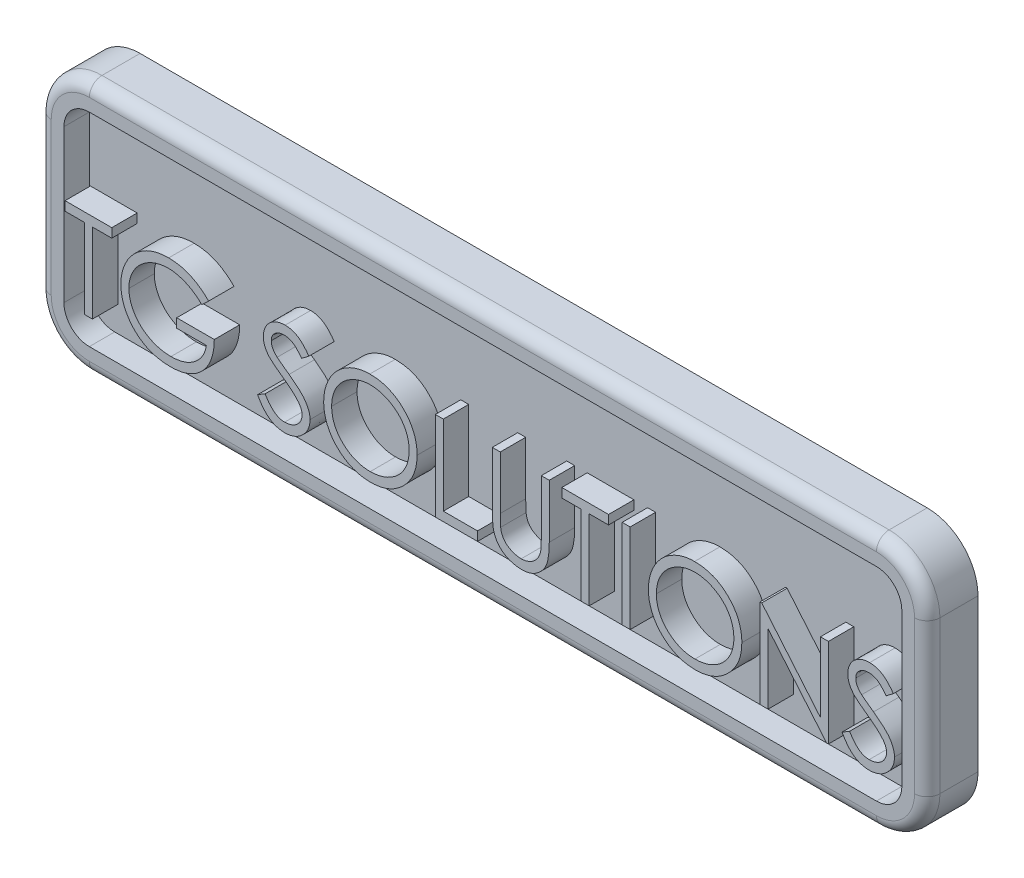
from build123d import *

# Parameters (mm, degrees)
BOSS_EXTRUDE1_DEPTH = 2
CUT_EXTRUDE2_DEPTH  = 1
FILLET3_R           = 0.5
SKETCH3_W           = 0.314102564
SKETCH3_H           = 3.5
BOSS_EXTRUDE2_DEPTH = 1


with BuildPart() as part:
    # Sketch1 → Boss-Extrude1 (new body)
    with BuildSketch(Plane.XY):
        with BuildLine():
            Line((2, 0), (33, 0))
            ThreePointArc((33, 0), (34.414213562, 0.585786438), (35, 2))
            Line((35, 2), (35, 8))
            ThreePointArc((35, 8), (34.414213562, 9.414213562), (33, 10))
            Line((33, 10), (2, 10))
            ThreePointArc((2, 10), (0.585786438, 9.414213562), (0, 8))
            Line((0, 8), (0, 2))
            ThreePointArc((0, 2), (0.585786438, 0.585786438), (2, 0))
        make_face()
    extrude(amount=BOSS_EXTRUDE1_DEPTH)

    # Sketch2 → Cut-Extrude2 (cut)
    with BuildSketch(Plane.XY.offset(2)):
        with BuildLine():
            Line((33, 9), (2, 9))
            ThreePointArc((2, 9), (1.292893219, 8.707106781), (1, 8))
            Line((1, 8), (1, 2))
            ThreePointArc((1, 2), (1.292893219, 1.292893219), (2, 1))
            Line((2, 1), (33, 1))
            ThreePointArc((33, 1), (33.707106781, 1.292893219), (34, 2))
            Line((34, 2), (34, 8))
            ThreePointArc((34, 8), (33.707106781, 8.707106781), (33, 9))
        make_face()
    extrude(amount=-CUT_EXTRUDE2_DEPTH, mode=Mode.SUBTRACT)

    # Fillet3
    fillet3_edges = [part.edges().sort_by_distance(p)[0] for p in [
        (0.585786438, 9.414213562, 2),
        (0, 5, 2),
        (0.585786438, 0.585786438, 2),
        (17.5, 0, 2),
        (34.414213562, 0.585786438, 2),
        (35, 5, 2),
        (34.414213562, 9.414213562, 2),
        (17.5, 10, 2),
    ]]
    fillet(fillet3_edges, radius=FILLET3_R)

    # Sketch3 → Boss-Extrude2 (add)
    # profile 1 of 11: a face of its own
    with BuildSketch(Plane.XY.offset(1)):
        Polygon((1.044871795, 5.141025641), (1.044871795, 5.5), (2.884615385, 5.5), (2.884615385, 5.141025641), (2.121794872, 5.141025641), (2.121794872, 2), (1.807692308, 2), (1.807692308, 5.141025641), align=None)
    # profile 2 of 11: a face of its own
    with BuildSketch(Plane.XY.offset(1)):
        with BuildLine():
            Line((6.698717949, 4.902644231), (6.429487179, 4.647435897))
            add(Edge.make_bspline(
                [(6.429487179, 4.647435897), (6.380768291, 4.69326676), (6.284492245, 4.783835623), (6.127532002, 4.901346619), (5.963768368, 5.002012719), (5.794055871, 5.083918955), (5.622597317, 5.149271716), (5.451668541, 5.195799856), (5.28302284, 5.225472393), (5.170855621, 5.229020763), (5.115584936, 5.230769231)],
                knots=[0, 0, 0, 0, 1.08915593, 2.152340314, 3.188132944, 4.216796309, 5.218260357, 6.173443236, 7.099959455, 8, 8, 8, 8], degree=3))
            add(Edge.make_bspline(
                [(5.115584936, 5.230769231), (5.081670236, 5.230355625), (5.013928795, 5.229529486), (4.913306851, 5.218985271), (4.813740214, 5.203820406), (4.71541684, 5.181878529), (4.618145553, 5.154069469), (4.522264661, 5.119284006), (4.427595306, 5.078728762), (4.335029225, 5.031866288), (4.245288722, 4.980386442), (4.160531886, 4.923337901), (4.080218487, 4.862549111), (4.005858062, 4.796498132), (3.937022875, 4.725783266), (3.872074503, 4.65171996), (3.813297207, 4.572284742), (3.760206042, 4.488939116), (3.712844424, 4.403146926), (3.67103577, 4.315733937), (3.635938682, 4.226990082), (3.608169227, 4.136804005), (3.585258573, 4.045873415), (3.569140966, 3.953568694), (3.560054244, 3.859791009), (3.558482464, 3.79699375), (3.557692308, 3.765424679)],
                knots=[0, 0, 0, 0, 1.02818874, 2.053710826, 3.065248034, 4.081641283, 5.106893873, 6.131558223, 7.173050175, 8.228653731, 9.27666206, 10.308777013, 11.325269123, 12.329503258, 13.32196095, 14.316845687, 15.314881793, 16.315733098, 17.311955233, 18.285320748, 19.252783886, 20.203351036, 21.145449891, 22.095197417, 23.042428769, 24, 24, 24, 24], degree=3))
            add(Edge.make_bspline(
                [(3.557692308, 3.765424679), (3.558448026, 3.733153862), (3.559957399, 3.668700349), (3.569617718, 3.572506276), (3.587545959, 3.477740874), (3.611513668, 3.384092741), (3.641494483, 3.291401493), (3.67886715, 3.200068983), (3.72313275, 3.110098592), (3.774369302, 3.022300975), (3.830555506, 2.936777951), (3.893498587, 2.85621843), (3.96035917, 2.779549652), (4.03357307, 2.708473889), (4.110792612, 2.641089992), (4.194324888, 2.57925447), (4.282527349, 2.521776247), (4.37553456, 2.469379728), (4.472337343, 2.422571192), (4.571594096, 2.380947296), (4.673621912, 2.346667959), (4.777884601, 2.318729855), (4.884257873, 2.295829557), (4.993281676, 2.281097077), (5.104154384, 2.270406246), (5.178893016, 2.269624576), (5.216546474, 2.269230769)],
                knots=[0, 0, 0, 0, 0.93586088, 1.869166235, 2.799637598, 3.729985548, 4.670839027, 5.622275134, 6.589130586, 7.576015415, 8.568469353, 9.55398029, 10.53834874, 11.515998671, 12.510579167, 13.508179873, 14.527009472, 15.561807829, 16.601455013, 17.643573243, 18.680854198, 19.719860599, 20.772568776, 21.833555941, 22.908541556, 24, 24, 24, 24], degree=3))
            add(Edge.make_bspline(
                [(5.216546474, 2.269230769), (5.261924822, 2.270179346), (5.351032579, 2.272042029), (5.482019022, 2.286542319), (5.607822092, 2.309189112), (5.728088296, 2.342355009), (5.842957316, 2.384658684), (5.952850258, 2.43565407), (6.056901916, 2.49729713), (6.15542509, 2.566870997), (6.246182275, 2.644385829), (6.328036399, 2.728030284), (6.399681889, 2.817398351), (6.462186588, 2.911963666), (6.513895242, 3.012508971), (6.556338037, 3.118541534), (6.588871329, 3.230109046), (6.602226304, 3.307200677), (6.608974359, 3.346153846)],
                knots=[0, 0, 0, 0, 1.13008108, 2.219097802, 3.278683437, 4.311054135, 5.322181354, 6.324827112, 7.324222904, 8.330512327, 9.32562643, 10.293043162, 11.24128371, 12.174520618, 13.111833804, 14.052305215, 15.015860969, 16, 16, 16, 16], degree=3))
            Line((6.608974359, 3.346153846), (5.442307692, 3.346153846))
            Line((5.442307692, 3.346153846), (5.442307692, 3.705128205))
            Line((5.442307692, 3.705128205), (6.923076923, 3.705128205))
            add(Edge.make_bspline(
                [(6.923076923, 3.705128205), (6.921371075, 3.638220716), (6.918032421, 3.507270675), (6.894613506, 3.316300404), (6.856796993, 3.13592871), (6.805136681, 2.965965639), (6.738261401, 2.806652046), (6.656888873, 2.65782618), (6.559716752, 2.520449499), (6.45020631, 2.393400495), (6.327306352, 2.280071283), (6.194337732, 2.180465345), (6.051080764, 2.09656273), (5.897670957, 2.028302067), (5.734610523, 1.975028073), (5.561522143, 1.937256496), (5.378640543, 1.914626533), (5.253303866, 1.911735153), (5.189202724, 1.91025641)],
                knots=[0, 0, 0, 0, 1.140356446, 2.231883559, 3.274166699, 4.278491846, 5.25512956, 6.21435461, 7.1637429, 8.11826594, 9.068280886, 10.0076534, 10.945064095, 11.891975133, 12.864533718, 13.863980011, 14.907571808, 16, 16, 16, 16], degree=3))
            add(Edge.make_bspline(
                [(5.189202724, 1.91025641), (5.149692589, 1.910825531), (5.071765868, 1.911948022), (4.95667494, 1.919925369), (4.844757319, 1.932205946), (4.736029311, 1.950751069), (4.630090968, 1.973465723), (4.527471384, 2.002552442), (4.427779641, 2.036221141), (4.330861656, 2.074516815), (4.237597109, 2.118888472), (4.147570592, 2.168198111), (4.060284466, 2.222191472), (3.976333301, 2.281802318), (3.89527968, 2.346584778), (3.817646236, 2.416668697), (3.742998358, 2.491839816), (3.696237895, 2.545218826), (3.672676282, 2.572115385)],
                knots=[0, 0, 0, 0, 1.107784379, 2.184907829, 3.233506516, 4.263428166, 5.276301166, 6.270063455, 7.25232949, 8.225834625, 9.190232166, 10.146266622, 11.1027726, 12.066435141, 13.031522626, 14.010570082, 14.99756817, 16, 16, 16, 16], degree=3))
            add(Edge.make_bspline(
                [(3.672676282, 2.572115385), (3.63849035, 2.614786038), (3.570685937, 2.699419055), (3.483407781, 2.835018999), (3.409006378, 2.975420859), (3.348638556, 3.121015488), (3.30150047, 3.271666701), (3.267694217, 3.427181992), (3.247886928, 3.587761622), (3.24503339, 3.696426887), (3.243589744, 3.751402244)],
                knots=[0, 0, 0, 0, 1.023165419, 2.029347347, 3.013907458, 3.994755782, 4.975994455, 5.96558838, 6.970761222, 8, 8, 8, 8], degree=3))
            add(Edge.make_bspline(
                [(3.243589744, 3.751402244), (3.244121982, 3.792568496), (3.245179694, 3.874377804), (3.25800521, 3.995835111), (3.276406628, 4.115135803), (3.303453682, 4.23218236), (3.337549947, 4.347052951), (3.380103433, 4.459800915), (3.429648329, 4.570492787), (3.487233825, 4.678366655), (3.551318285, 4.781991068), (3.620868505, 4.880948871), (3.696872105, 4.973437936), (3.778087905, 5.060629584), (3.865484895, 5.141428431), (3.958244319, 5.216582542), (4.056437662, 5.286192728), (4.160373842, 5.349162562), (4.268501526, 5.405726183), (4.380561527, 5.455315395), (4.496519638, 5.49629871), (4.615507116, 5.53107249), (4.738424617, 5.55678763), (4.864380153, 5.575436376), (4.994030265, 5.588196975), (5.081666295, 5.589223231), (5.126101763, 5.58974359)],
                knots=[0, 0, 0, 0, 1.008945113, 2.00506715, 2.99143336, 3.967273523, 4.948097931, 5.927297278, 6.919902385, 7.919676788, 8.923139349, 9.905703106, 10.883022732, 11.856032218, 12.825136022, 13.798837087, 14.781400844, 15.773989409, 16.776158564, 17.77167057, 18.775803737, 19.789618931, 20.80898985, 21.851988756, 22.910860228, 24, 24, 24, 24], degree=3))
            add(Edge.make_bspline(
                [(5.126101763, 5.58974359), (5.162340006, 5.589164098), (5.234196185, 5.588015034), (5.341121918, 5.580050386), (5.446394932, 5.567426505), (5.550171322, 5.550199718), (5.652097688, 5.526736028), (5.752464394, 5.498657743), (5.85141693, 5.46596592), (5.948645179, 5.426977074), (6.044802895, 5.382723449), (6.140424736, 5.332910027), (6.235183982, 5.276685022), (6.329244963, 5.213881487), (6.423200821, 5.145578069), (6.515565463, 5.069821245), (6.608568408, 4.989598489), (6.668370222, 4.931916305), (6.698717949, 4.902644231)],
                knots=[0, 0, 0, 0, 0.985871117, 1.954866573, 2.915460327, 3.869826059, 4.81536089, 5.759505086, 6.70452669, 7.649098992, 8.607881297, 9.583363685, 10.581137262, 11.603961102, 12.659522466, 13.73993555, 14.853081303, 16, 16, 16, 16], degree=3))
        make_face()
    # profile 3 of 11: a face of its own
    with BuildSketch(Plane.XY.offset(1)):
        with BuildLine():
            Line((8.628205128, 2.675180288), (8.924078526, 2.852564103))
            add(Edge.make_bspline(
                [(8.924078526, 2.852564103), (8.951596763, 2.806499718), (9.004320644, 2.718242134), (9.092272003, 2.598984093), (9.183404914, 2.497621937), (9.278394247, 2.414745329), (9.376660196, 2.349496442), (9.478844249, 2.303294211), (9.58460206, 2.274478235), (9.656575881, 2.270978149), (9.692508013, 2.269230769)],
                knots=[0, 0, 0, 0, 1.272034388, 2.437168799, 3.508375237, 4.49857839, 5.41946034, 6.295179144, 7.148887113, 8, 8, 8, 8], degree=3))
            add(Edge.make_bspline(
                [(9.692508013, 2.269230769), (9.723194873, 2.270085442), (9.784031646, 2.271779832), (9.873593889, 2.288060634), (9.960575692, 2.313072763), (10.043184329, 2.348893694), (10.120279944, 2.39223218), (10.187886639, 2.444578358), (10.246332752, 2.503184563), (10.294141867, 2.568567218), (10.330821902, 2.638884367), (10.359013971, 2.711060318), (10.374659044, 2.786228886), (10.377015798, 2.836839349), (10.378205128, 2.862379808)],
                knots=[0, 0, 0, 0, 1.095163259, 2.171163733, 3.241058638, 4.321873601, 5.38011039, 6.391990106, 7.366004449, 8.327778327, 9.272591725, 10.192022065, 11.087607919, 12, 12, 12, 12], degree=3))
            add(Edge.make_bspline(
                [(10.378205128, 2.862379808), (10.376730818, 2.891520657), (10.373733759, 2.950759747), (10.348402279, 3.0381594), (10.308553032, 3.12465197), (10.271790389, 3.178153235), (10.252704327, 3.205929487)],
                knots=[0, 0, 0, 0, 0.938893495, 1.908633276, 2.914225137, 4, 4, 4, 4], degree=3))
            add(Edge.make_bspline(
                [(10.252704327, 3.205929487), (10.237033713, 3.225976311), (10.204135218, 3.268062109), (10.147577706, 3.330707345), (10.081211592, 3.395325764), (10.007308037, 3.464384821), (9.923174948, 3.534672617), (9.831447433, 3.609540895), (9.729783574, 3.686142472), (9.658484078, 3.737515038), (9.621694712, 3.764022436)],
                knots=[0, 0, 0, 0, 0.722233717, 1.516239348, 2.393582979, 3.351407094, 4.387010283, 5.505090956, 6.712668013, 8, 8, 8, 8], degree=3))
            add(Edge.make_bspline(
                [(9.621694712, 3.764022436), (9.584870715, 3.790251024), (9.514466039, 3.840398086), (9.416007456, 3.91482237), (9.327962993, 3.982866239), (9.250723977, 4.045170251), (9.18432438, 4.101742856), (9.128240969, 4.152040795), (9.083902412, 4.197424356), (9.059246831, 4.226865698), (9.048177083, 4.240084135)],
                knots=[0, 0, 0, 0, 1.452282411, 2.77665338, 3.964542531, 5.026858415, 5.96415736, 6.766646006, 7.446254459, 8, 8, 8, 8], degree=3))
            add(Edge.make_bspline(
                [(9.048177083, 4.240084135), (9.032704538, 4.260685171), (9.002275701, 4.301199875), (8.962109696, 4.364524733), (8.927970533, 4.429347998), (8.901208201, 4.495843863), (8.878671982, 4.563078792), (8.863514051, 4.631930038), (8.854022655, 4.702088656), (8.853050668, 4.749302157), (8.852564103, 4.772936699)],
                knots=[0, 0, 0, 0, 1.068054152, 2.10047183, 3.106115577, 4.101338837, 5.06977816, 6.043150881, 7.020423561, 8, 8, 8, 8], degree=3))
            add(Edge.make_bspline(
                [(8.852564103, 4.772936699), (8.853869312, 4.809966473), (8.856451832, 4.883234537), (8.878292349, 4.990265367), (8.912765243, 5.092451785), (8.96106013, 5.188782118), (9.023317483, 5.276748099), (9.095363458, 5.357361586), (9.181174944, 5.425130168), (9.275327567, 5.484342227), (9.378383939, 5.530688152), (9.486374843, 5.565649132), (9.599471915, 5.58545839), (9.676075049, 5.588301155), (9.71494391, 5.58974359)],
                knots=[0, 0, 0, 0, 1.005424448, 1.989358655, 2.955360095, 3.929531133, 4.905563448, 5.876582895, 6.856512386, 7.866279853, 8.892233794, 9.918561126, 10.94386622, 12, 12, 12, 12], degree=3))
            add(Edge.make_bspline(
                [(9.71494391, 5.58974359), (9.756188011, 5.588321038), (9.838209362, 5.585492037), (9.958858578, 5.560894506), (10.075019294, 5.520193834), (10.168462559, 5.474005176), (10.241595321, 5.42787376), (10.297368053, 5.385853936), (10.353885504, 5.337478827), (10.411603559, 5.282619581), (10.469544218, 5.22077283), (10.528567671, 5.152362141), (10.588811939, 5.077805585), (10.627567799, 5.024581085), (10.647435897, 4.997295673)],
                knots=[0, 0, 0, 0, 1.286793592, 2.559021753, 3.825965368, 5.121522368, 5.803751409, 6.523245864, 7.299691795, 8.125521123, 9.008227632, 9.944561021, 10.946284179, 12, 12, 12, 12], degree=3))
            Line((10.647435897, 4.997295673), (10.363481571, 4.782051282))
            add(Edge.make_bspline(
                [(10.363481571, 4.782051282), (10.346335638, 4.804139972), (10.313316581, 4.846677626), (10.263187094, 4.906248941), (10.215938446, 4.960665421), (10.169388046, 5.007930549), (10.125994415, 5.050632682), (10.083877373, 5.087192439), (10.043643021, 5.117968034), (9.992926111, 5.150811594), (9.929208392, 5.183368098), (9.849223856, 5.210917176), (9.765637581, 5.227472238), (9.70870795, 5.229661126), (9.679887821, 5.230769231)],
                knots=[0, 0, 0, 0, 1.181633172, 2.275549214, 3.290209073, 4.226197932, 5.078386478, 5.862611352, 6.581680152, 7.217281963, 8.414376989, 9.595101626, 10.782541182, 12, 12, 12, 12], degree=3))
            add(Edge.make_bspline(
                [(9.679887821, 5.230769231), (9.643731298, 5.229557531), (9.574006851, 5.227220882), (9.475016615, 5.201700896), (9.38592269, 5.161519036), (9.309370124, 5.105204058), (9.245633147, 5.038483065), (9.199527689, 4.96170421), (9.171777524, 4.876921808), (9.168391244, 4.817780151), (9.166666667, 4.787660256)],
                knots=[0, 0, 0, 0, 1.14458467, 2.207223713, 3.21896685, 4.227309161, 5.202851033, 6.127160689, 7.046193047, 8, 8, 8, 8], degree=3))
            add(Edge.make_bspline(
                [(9.166666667, 4.787660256), (9.167059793, 4.768908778), (9.167846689, 4.731375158), (9.178821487, 4.675923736), (9.192920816, 4.620612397), (9.215263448, 4.565689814), (9.246108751, 4.510195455), (9.286613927, 4.453173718), (9.337627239, 4.394122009), (9.376704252, 4.355714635), (9.397335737, 4.335436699)],
                knots=[0, 0, 0, 0, 0.858281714, 1.717966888, 2.583508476, 3.4729293, 4.427298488, 5.488583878, 6.674047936, 8, 8, 8, 8], degree=3))
            add(Edge.make_bspline(
                [(9.397335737, 4.335436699), (9.40499711, 4.328599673), (9.423198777, 4.312356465), (9.456474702, 4.285764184), (9.500417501, 4.252961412), (9.553879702, 4.212374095), (9.617847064, 4.165292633), (9.69232662, 4.112319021), (9.776488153, 4.051733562), (9.836210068, 4.009376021), (9.867788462, 3.986979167)],
                knots=[0, 0, 0, 0, 0.420754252, 0.999615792, 1.744751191, 2.668019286, 3.750313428, 4.999500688, 6.413464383, 8, 8, 8, 8], degree=3))
            add(Edge.make_bspline(
                [(9.867788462, 3.986979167), (9.905774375, 3.959337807), (9.979328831, 3.905814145), (10.083986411, 3.825398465), (10.178880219, 3.746750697), (10.264343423, 3.67037309), (10.341220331, 3.596844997), (10.408658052, 3.525281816), (10.467343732, 3.456196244), (10.530522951, 3.367623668), (10.59508077, 3.258842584), (10.650522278, 3.125564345), (10.685480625, 2.991768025), (10.690052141, 2.901841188), (10.692307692, 2.857471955)],
                knots=[0, 0, 0, 0, 1.163667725, 2.253281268, 3.268753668, 4.215851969, 5.092017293, 5.902905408, 6.650798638, 7.335211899, 8.59617414, 9.77448103, 10.901945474, 12, 12, 12, 12], degree=3))
            add(Edge.make_bspline(
                [(10.692307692, 2.857471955), (10.691650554, 2.82609359), (10.690349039, 2.763946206), (10.675388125, 2.67269113), (10.65346846, 2.58406026), (10.620431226, 2.499149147), (10.580108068, 2.416404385), (10.52894182, 2.337996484), (10.469634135, 2.262190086), (10.40160037, 2.191006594), (10.327154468, 2.125660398), (10.248470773, 2.067531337), (10.165420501, 2.019063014), (10.078454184, 1.979512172), (9.987551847, 1.948578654), (9.892744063, 1.926165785), (9.793874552, 1.912410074), (9.726674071, 1.910982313), (9.692508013, 1.91025641)],
                knots=[0, 0, 0, 0, 0.983748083, 1.948392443, 2.894712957, 3.844097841, 4.80183111, 5.778335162, 6.776009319, 7.81870978, 8.863265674, 9.881300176, 10.883814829, 11.87499822, 12.874611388, 13.892143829, 14.928324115, 16, 16, 16, 16], degree=3))
            add(Edge.make_bspline(
                [(9.692508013, 1.91025641), (9.66607267, 1.910767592), (9.61353491, 1.911783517), (9.535825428, 1.920764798), (9.459685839, 1.933471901), (9.386071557, 1.953645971), (9.314034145, 1.978122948), (9.243886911, 2.008261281), (9.175595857, 2.044378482), (9.108778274, 2.085673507), (9.043604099, 2.133731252), (8.980684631, 2.189704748), (8.917955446, 2.252050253), (8.857268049, 2.322460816), (8.797394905, 2.399798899), (8.739516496, 2.484788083), (8.682434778, 2.576965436), (8.64661931, 2.641830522), (8.628205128, 2.675180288)],
                knots=[0, 0, 0, 0, 0.915332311, 1.819136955, 2.706846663, 3.586547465, 4.459518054, 5.340707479, 6.227863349, 7.133153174, 8.059268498, 9.028702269, 10.047606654, 11.120612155, 12.245963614, 13.433783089, 14.680604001, 16, 16, 16, 16], degree=3))
        make_face()
    # profile 4 of 11: a face of its own
    with BuildSketch(Plane.XY.offset(1)):
        with BuildLine():
            add(Edge.make_bspline(
                [(13.048076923, 5.58974359), (13.112885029, 5.58810211), (13.240173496, 5.584878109), (13.427248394, 5.560199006), (13.605843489, 5.517503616), (13.777413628, 5.460640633), (13.939906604, 5.384786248), (14.094545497, 5.2931011), (14.240962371, 5.184624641), (14.377183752, 5.060195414), (14.501840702, 4.92481196), (14.611666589, 4.78033405), (14.703708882, 4.627635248), (14.77929467, 4.467174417), (14.838593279, 4.299314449), (14.879512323, 4.123160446), (14.905650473, 3.939853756), (14.908706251, 3.814826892), (14.91025641, 3.751402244)],
                knots=[0, 0, 0, 0, 1.065120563, 2.091984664, 3.0946048, 4.079830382, 5.057816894, 6.036188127, 7.030412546, 8.04752943, 9.064399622, 10.05169764, 11.02544977, 11.989514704, 12.962713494, 13.945757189, 14.957906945, 16, 16, 16, 16], degree=3))
            add(Edge.make_bspline(
                [(14.91025641, 3.751402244), (14.908706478, 3.688444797), (14.905651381, 3.564348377), (14.879482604, 3.382204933), (14.838441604, 3.207114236), (14.779845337, 3.039368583), (14.704619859, 2.87879102), (14.611964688, 2.725804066), (14.502823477, 2.580357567), (14.378616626, 2.444044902), (14.243215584, 2.319047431), (14.097985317, 2.210128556), (13.946191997, 2.116404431), (13.785882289, 2.041620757), (13.619182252, 1.981848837), (13.444599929, 1.941096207), (13.262953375, 1.914809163), (13.139082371, 1.911790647), (13.076121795, 1.91025641)],
                knots=[0, 0, 0, 0, 1.043624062, 2.057103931, 3.04512605, 4.022047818, 4.998200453, 5.980619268, 6.982898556, 8.009068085, 9.034988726, 10.034168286, 11.015286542, 11.987931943, 12.962482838, 13.94673481, 14.956375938, 16, 16, 16, 16], degree=3))
            add(Edge.make_bspline(
                [(13.076121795, 1.91025641), (13.012697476, 1.911805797), (12.88767126, 1.914860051), (12.704134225, 1.941041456), (12.527856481, 1.98198276), (12.35934213, 2.040492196), (12.1984972, 2.116109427), (12.045007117, 2.208313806), (11.89948797, 2.317720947), (11.763146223, 2.441887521), (11.638397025, 2.577059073), (11.52963765, 2.721893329), (11.437412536, 2.873548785), (11.362049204, 3.032446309), (11.302384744, 3.197817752), (11.261679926, 3.370766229), (11.235343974, 3.550305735), (11.232309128, 3.672548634), (11.230769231, 3.734575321)],
                knots=[0, 0, 0, 0, 1.053102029, 2.075944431, 3.073151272, 4.055350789, 5.033113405, 6.020478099, 7.024410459, 8.052272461, 9.079885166, 10.07527673, 11.055994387, 12.023226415, 12.992069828, 13.970394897, 14.97016774, 16, 16, 16, 16], degree=3))
            add(Edge.make_bspline(
                [(11.230769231, 3.734575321), (11.231303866, 3.77620799), (11.232366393, 3.858948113), (11.245158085, 3.981814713), (11.263719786, 4.102705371), (11.290321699, 4.221276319), (11.325113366, 4.337237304), (11.366165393, 4.451388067), (11.416305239, 4.56257179), (11.472985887, 4.671315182), (11.536247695, 4.775923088), (11.606123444, 4.874802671), (11.680158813, 4.968783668), (11.761322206, 5.055430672), (11.846938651, 5.137264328), (11.93839703, 5.213027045), (12.035139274, 5.283401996), (12.137581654, 5.346822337), (12.243199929, 5.404181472), (12.352076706, 5.453403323), (12.462733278, 5.495649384), (12.575687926, 5.529890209), (12.690640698, 5.556922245), (12.807842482, 5.575329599), (12.927199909, 5.588153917), (13.007611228, 5.589211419), (13.048076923, 5.58974359)],
                knots=[0, 0, 0, 0, 1.037015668, 2.060948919, 3.074880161, 4.083647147, 5.086022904, 6.090072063, 7.104153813, 8.122640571, 9.144368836, 10.147691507, 11.138137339, 12.123020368, 13.103399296, 14.087645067, 15.080126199, 16.082011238, 17.087798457, 18.072939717, 19.057185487, 20.037253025, 21.01195951, 21.997135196, 22.992090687, 24, 24, 24, 24], degree=3))
        make_face()
        with BuildLine():
            add(Edge.make_bspline(
                [(13.063501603, 5.230769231), (13.030286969, 5.230364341), (12.964175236, 5.229558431), (12.8658907, 5.218942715), (12.768898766, 5.203812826), (12.673179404, 5.182231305), (12.579133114, 5.152827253), (12.485883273, 5.118986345), (12.394280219, 5.077765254), (12.304626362, 5.03119255), (12.217711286, 4.979643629), (12.135698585, 4.922671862), (12.058375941, 4.861613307), (11.985932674, 4.79632547), (11.918581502, 4.726475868), (11.854996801, 4.653123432), (11.797727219, 4.574171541), (11.745241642, 4.491761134), (11.698273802, 4.405999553), (11.656508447, 4.317789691), (11.622344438, 4.226412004), (11.594482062, 4.132857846), (11.571382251, 4.037275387), (11.556748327, 3.938939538), (11.546015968, 3.838344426), (11.545256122, 3.770362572), (11.544871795, 3.735977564)],
                knots=[0, 0, 0, 0, 1.008559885, 2.007477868, 2.99961109, 3.989939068, 4.984837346, 5.991145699, 7.001802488, 8.033829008, 9.059044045, 10.069351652, 11.065060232, 12.050310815, 13.029377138, 14.011219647, 14.996725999, 15.989392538, 16.977580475, 17.965360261, 18.951710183, 19.937753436, 20.929683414, 21.935841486, 22.955955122, 24, 24, 24, 24], degree=3))
            add(Edge.make_bspline(
                [(11.544871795, 3.735977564), (11.546146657, 3.685415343), (11.548654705, 3.585943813), (11.570612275, 3.440175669), (11.604434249, 3.300087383), (11.654291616, 3.166445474), (11.71664223, 3.038101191), (11.793669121, 2.916193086), (11.884928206, 2.800688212), (11.988591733, 2.692392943), (12.101914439, 2.593547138), (12.222247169, 2.50678373), (12.348300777, 2.43337348), (12.48040398, 2.373568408), (12.617851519, 2.32617867), (12.76152907, 2.293700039), (12.910479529, 2.272324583), (13.012010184, 2.270271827), (13.063501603, 2.269230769)],
                knots=[0, 0, 0, 0, 1.032063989, 2.030389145, 3.003944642, 3.970395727, 4.937377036, 5.913328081, 6.909231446, 7.93887556, 8.970685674, 9.976071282, 10.964166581, 11.944589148, 12.933237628, 13.927779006, 14.949070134, 16, 16, 16, 16], degree=3))
            add(Edge.make_bspline(
                [(13.063501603, 2.269230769), (13.098111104, 2.269706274), (13.166752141, 2.270649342), (13.268847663, 2.280148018), (13.369103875, 2.295379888), (13.467380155, 2.317310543), (13.563564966, 2.34475775), (13.658059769, 2.377365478), (13.749858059, 2.418046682), (13.840117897, 2.462994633), (13.926514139, 2.514234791), (14.008989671, 2.56927294), (14.085465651, 2.630241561), (14.157854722, 2.694559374), (14.225482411, 2.763523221), (14.287891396, 2.837043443), (14.344871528, 2.9155841), (14.397337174, 2.997869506), (14.444140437, 3.083865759), (14.484919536, 3.172395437), (14.519515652, 3.263240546), (14.547444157, 3.356532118), (14.569329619, 3.452092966), (14.584409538, 3.550051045), (14.594957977, 3.650210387), (14.595753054, 3.717954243), (14.596153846, 3.752103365)],
                knots=[0, 0, 0, 0, 1.047197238, 2.076906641, 3.100256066, 4.114471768, 5.12198147, 6.126382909, 7.136867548, 8.15857795, 9.17633901, 10.174870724, 11.156907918, 12.133735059, 13.104061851, 14.077631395, 15.04955518, 16.038496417, 17.029181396, 18.010275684, 18.986308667, 19.968651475, 20.955262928, 21.950658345, 22.966943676, 24, 24, 24, 24], degree=3))
            add(Edge.make_bspline(
                [(14.596153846, 3.752103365), (14.595752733, 3.78601887), (14.594957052, 3.85329652), (14.584414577, 3.952757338), (14.569313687, 4.05001055), (14.547550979, 4.144674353), (14.519500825, 4.236772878), (14.484913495, 4.326219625), (14.444128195, 4.413347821), (14.397319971, 4.497942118), (14.344704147, 4.579116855), (14.287209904, 4.656719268), (14.223844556, 4.729292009), (14.156418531, 4.798626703), (14.083247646, 4.863244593), (14.004663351, 4.923167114), (13.921619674, 4.979840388), (13.833692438, 5.03096595), (13.742948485, 5.078180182), (13.649834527, 5.118631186), (13.555405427, 5.153003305), (13.459901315, 5.18232027), (13.362518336, 5.2037283), (13.263914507, 5.21895635), (13.164226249, 5.229554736), (13.097183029, 5.230363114), (13.063501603, 5.230769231)],
                knots=[0, 0, 0, 0, 1.02996197, 2.043119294, 3.035359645, 4.018872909, 4.991431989, 5.957985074, 6.929999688, 7.912076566, 8.892894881, 9.867085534, 10.843653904, 11.817741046, 12.803660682, 13.806313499, 14.818574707, 15.856120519, 16.894564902, 17.924820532, 18.937903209, 19.946497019, 20.957711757, 21.963978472, 22.977135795, 24, 24, 24, 24], degree=3))
        make_face(mode=Mode.SUBTRACT)
    # profile 5 of 11: a face of its own
    with BuildSketch(Plane.XY.offset(1)):
        Polygon((15.628205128, 5.5), (15.942307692, 5.5), (15.942307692, 2.358974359), (17.288461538, 2.358974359), (17.288461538, 2), (15.628205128, 2), align=None)
    # profile 6 of 11: a face of its own
    with BuildSketch(Plane.XY.offset(1)):
        with BuildLine():
            Line((17.871794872, 5.5), (18.185897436, 5.5))
            Line((18.185897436, 5.5), (18.185897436, 3.402944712))
            add(Edge.make_bspline(
                [(18.185897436, 3.402944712), (18.185850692, 3.373263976), (18.185761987, 3.316939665), (18.186354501, 3.236771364), (18.188013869, 3.165498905), (18.189060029, 3.102847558), (18.191387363, 3.04910481), (18.193285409, 3.0039795), (18.195725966, 2.967685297), (18.198659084, 2.946504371), (18.199919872, 2.93739984)],
                knots=[0, 0, 0, 0, 1.528628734, 2.90083645, 4.128790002, 5.200304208, 6.127813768, 6.898992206, 7.526736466, 8, 8, 8, 8], degree=3))
            add(Edge.make_bspline(
                [(18.199919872, 2.93739984), (18.205097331, 2.904553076), (18.215160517, 2.840710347), (18.240806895, 2.749802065), (18.276624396, 2.667870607), (18.319067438, 2.592359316), (18.37500005, 2.525369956), (18.442003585, 2.463658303), (18.523181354, 2.409686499), (18.613441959, 2.360335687), (18.710727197, 2.320670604), (18.810138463, 2.29067724), (18.910181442, 2.27239834), (18.977157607, 2.270281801), (19.010416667, 2.269230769)],
                knots=[0, 0, 0, 0, 1.035780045, 2.013197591, 2.933192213, 3.817615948, 4.702609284, 5.640816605, 6.646850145, 7.73207398, 8.84249596, 9.914020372, 10.964143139, 12, 12, 12, 12], degree=3))
            add(Edge.make_bspline(
                [(19.010416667, 2.269230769), (19.038970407, 2.27030462), (19.095912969, 2.272446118), (19.1805194, 2.285707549), (19.262919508, 2.309608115), (19.343520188, 2.340447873), (19.419071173, 2.381195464), (19.489614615, 2.428266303), (19.552578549, 2.48347718), (19.610036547, 2.544577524), (19.660071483, 2.613517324), (19.703442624, 2.688795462), (19.738968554, 2.771544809), (19.756512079, 2.829699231), (19.76552484, 2.859575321)],
                knots=[0, 0, 0, 0, 0.994687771, 1.983630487, 2.973142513, 3.978332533, 4.983357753, 5.956394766, 6.925816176, 7.893390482, 8.871859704, 9.88551698, 10.913711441, 12, 12, 12, 12], degree=3))
            add(Edge.make_bspline(
                [(19.76552484, 2.859575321), (19.768524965, 2.871923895), (19.775210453, 2.899441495), (19.781457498, 2.945962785), (19.787964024, 3.000852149), (19.792478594, 3.064503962), (19.796879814, 3.136704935), (19.799512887, 3.217831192), (19.80072992, 3.307588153), (19.8010926, 3.370225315), (19.801282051, 3.402944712)],
                knots=[0, 0, 0, 0, 0.558680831, 1.244966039, 2.062412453, 2.990489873, 4.051219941, 5.244515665, 6.560634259, 8, 8, 8, 8], degree=3))
            Line((19.801282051, 3.402944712), (19.801282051, 5.5))
            Line((19.801282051, 5.5), (20.115384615, 5.5))
            Line((20.115384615, 5.5), (20.115384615, 3.386117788))
            add(Edge.make_bspline(
                [(20.115384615, 3.386117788), (20.115130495, 3.34801941), (20.114634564, 3.273668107), (20.110333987, 3.164716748), (20.103476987, 3.061363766), (20.093788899, 2.96359527), (20.080951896, 2.871761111), (20.066676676, 2.785056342), (20.048497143, 2.70410335), (20.027263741, 2.628270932), (20.002990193, 2.556085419), (19.971549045, 2.487576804), (19.936124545, 2.420662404), (19.894109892, 2.356354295), (19.84689851, 2.294367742), (19.793446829, 2.235078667), (19.735522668, 2.177539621), (19.672163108, 2.123226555), (19.604412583, 2.073417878), (19.532472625, 2.029620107), (19.456895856, 1.992596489), (19.377878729, 1.962120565), (19.295387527, 1.939205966), (19.209420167, 1.92213081), (19.119780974, 1.912428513), (19.058816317, 1.910986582), (19.027944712, 1.91025641)],
                knots=[0, 0, 0, 0, 1.316592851, 2.569410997, 3.76748051, 4.895814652, 5.963796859, 6.97159953, 7.931736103, 8.829262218, 9.692595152, 10.560224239, 11.431080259, 12.30701507, 13.211635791, 14.121146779, 15.063487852, 16.031507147, 17.00238618, 17.966455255, 18.938106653, 19.907068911, 20.888905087, 21.893141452, 22.933117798, 24, 24, 24, 24], degree=3))
            add(Edge.make_bspline(
                [(19.027944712, 1.91025641), (18.994275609, 1.911041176), (18.92821695, 1.912580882), (18.830878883, 1.921403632), (18.737564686, 1.938022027), (18.647288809, 1.95918197), (18.561280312, 1.988365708), (18.478386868, 2.022463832), (18.400028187, 2.064341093), (18.324933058, 2.110934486), (18.255108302, 2.163359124), (18.191010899, 2.220499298), (18.132535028, 2.281439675), (18.080666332, 2.346840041), (18.034545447, 2.416191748), (17.994815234, 2.489690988), (17.96070199, 2.567309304), (17.943095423, 2.621262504), (17.934194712, 2.64853766)],
                knots=[0, 0, 0, 0, 1.13879206, 2.234305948, 3.301075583, 4.341971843, 5.366689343, 6.369221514, 7.369726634, 8.367512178, 9.355451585, 10.318319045, 11.268648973, 12.207971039, 13.137398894, 14.081662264, 15.030215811, 16, 16, 16, 16], degree=3))
            add(Edge.make_bspline(
                [(17.934194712, 2.64853766), (17.929017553, 2.667170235), (17.917788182, 2.707584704), (17.905762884, 2.774471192), (17.895653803, 2.85148611), (17.886148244, 2.938634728), (17.880539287, 3.035984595), (17.875621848, 3.143493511), (17.871760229, 3.261291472), (17.871783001, 3.343345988), (17.871794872, 3.386117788)],
                knots=[0, 0, 0, 0, 0.625038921, 1.35572334, 2.194682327, 3.136881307, 4.189498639, 5.346923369, 6.617055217, 8, 8, 8, 8], degree=3))
            Line((17.871794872, 3.386117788), (17.871794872, 5.5))
        make_face()
    # profile 7 of 11: a face of its own
    with BuildSketch(Plane.XY.offset(1)):
        Polygon((20.608974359, 5.141025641), (20.608974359, 5.5), (22.448717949, 5.5), (22.448717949, 5.141025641), (21.685897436, 5.141025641), (21.685897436, 2), (21.371794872, 2), (21.371794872, 5.141025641), align=None)
    # profile 8 of 11: a face of its own
    with BuildSketch(Plane.XY.offset(1)):
        with Locations((23.144230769, 3.75)):
            Rectangle(SKETCH3_W, SKETCH3_H)
    # profile 9 of 11: a face of its own
    with BuildSketch(Plane.XY.offset(1)):
        with BuildLine():
            add(Edge.make_bspline(
                [(25.836538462, 5.58974359), (25.901346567, 5.58810211), (26.028635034, 5.584878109), (26.215709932, 5.560199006), (26.394305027, 5.517503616), (26.565875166, 5.460640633), (26.728368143, 5.384786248), (26.883007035, 5.2931011), (27.029423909, 5.184624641), (27.165645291, 5.060195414), (27.290302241, 4.92481196), (27.400128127, 4.78033405), (27.492170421, 4.627635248), (27.567756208, 4.467174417), (27.627054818, 4.299314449), (27.667973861, 4.123160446), (27.694112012, 3.939853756), (27.697167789, 3.814826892), (27.698717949, 3.751402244)],
                knots=[0, 0, 0, 0, 1.065120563, 2.091984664, 3.0946048, 4.079830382, 5.057816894, 6.036188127, 7.030412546, 8.04752943, 9.064399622, 10.05169764, 11.02544977, 11.989514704, 12.962713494, 13.945757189, 14.957906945, 16, 16, 16, 16], degree=3))
            add(Edge.make_bspline(
                [(27.698717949, 3.751402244), (27.697168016, 3.688444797), (27.69411292, 3.564348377), (27.667944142, 3.382204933), (27.626903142, 3.207114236), (27.568306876, 3.039368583), (27.493081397, 2.87879102), (27.400426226, 2.725804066), (27.291285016, 2.580357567), (27.167078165, 2.444044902), (27.031677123, 2.319047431), (26.886446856, 2.210128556), (26.734653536, 2.116404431), (26.574343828, 2.041620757), (26.407643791, 1.981848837), (26.233061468, 1.941096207), (26.051414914, 1.914809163), (25.92754391, 1.911790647), (25.864583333, 1.91025641)],
                knots=[0, 0, 0, 0, 1.043624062, 2.057103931, 3.04512605, 4.022047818, 4.998200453, 5.980619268, 6.982898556, 8.009068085, 9.034988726, 10.034168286, 11.015286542, 11.987931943, 12.962482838, 13.94673481, 14.956375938, 16, 16, 16, 16], degree=3))
            add(Edge.make_bspline(
                [(25.864583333, 1.91025641), (25.801159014, 1.911805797), (25.676132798, 1.914860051), (25.492595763, 1.941041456), (25.316318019, 1.98198276), (25.147803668, 2.040492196), (24.986958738, 2.116109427), (24.833468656, 2.208313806), (24.687949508, 2.317720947), (24.551607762, 2.441887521), (24.426858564, 2.577059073), (24.318099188, 2.721893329), (24.225874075, 2.873548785), (24.150510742, 3.032446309), (24.090846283, 3.197817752), (24.050141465, 3.370766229), (24.023805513, 3.550305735), (24.020770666, 3.672548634), (24.019230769, 3.734575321)],
                knots=[0, 0, 0, 0, 1.053102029, 2.075944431, 3.073151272, 4.055350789, 5.033113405, 6.020478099, 7.024410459, 8.052272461, 9.079885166, 10.07527673, 11.055994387, 12.023226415, 12.992069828, 13.970394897, 14.97016774, 16, 16, 16, 16], degree=3))
            add(Edge.make_bspline(
                [(24.019230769, 3.734575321), (24.019765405, 3.77620799), (24.020827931, 3.858948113), (24.033619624, 3.981814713), (24.052181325, 4.102705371), (24.078783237, 4.221276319), (24.113574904, 4.337237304), (24.154626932, 4.451388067), (24.204766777, 4.56257179), (24.261447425, 4.671315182), (24.324709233, 4.775923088), (24.394584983, 4.874802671), (24.468620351, 4.968783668), (24.549783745, 5.055430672), (24.63540019, 5.137264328), (24.726858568, 5.213027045), (24.823600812, 5.283401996), (24.926043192, 5.346822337), (25.031661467, 5.404181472), (25.140538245, 5.453403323), (25.251194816, 5.495649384), (25.364149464, 5.529890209), (25.479102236, 5.556922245), (25.596304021, 5.575329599), (25.715661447, 5.588153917), (25.796072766, 5.589211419), (25.836538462, 5.58974359)],
                knots=[0, 0, 0, 0, 1.037015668, 2.060948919, 3.074880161, 4.083647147, 5.086022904, 6.090072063, 7.104153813, 8.122640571, 9.144368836, 10.147691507, 11.138137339, 12.123020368, 13.103399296, 14.087645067, 15.080126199, 16.082011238, 17.087798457, 18.072939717, 19.057185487, 20.037253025, 21.01195951, 21.997135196, 22.992090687, 24, 24, 24, 24], degree=3))
        make_face()
        with BuildLine():
            add(Edge.make_bspline(
                [(25.851963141, 5.230769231), (25.818748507, 5.230364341), (25.752636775, 5.229558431), (25.654352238, 5.218942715), (25.557360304, 5.203812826), (25.461640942, 5.182231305), (25.367594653, 5.152827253), (25.274344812, 5.118986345), (25.182741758, 5.077765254), (25.0930879, 5.03119255), (25.006172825, 4.979643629), (24.924160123, 4.922671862), (24.846837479, 4.861613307), (24.774394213, 4.79632547), (24.707043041, 4.726475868), (24.643458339, 4.653123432), (24.586188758, 4.574171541), (24.533703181, 4.491761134), (24.48673534, 4.405999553), (24.444969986, 4.317789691), (24.410805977, 4.226412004), (24.382943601, 4.132857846), (24.35984379, 4.037275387), (24.345209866, 3.938939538), (24.334477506, 3.838344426), (24.333717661, 3.770362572), (24.333333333, 3.735977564)],
                knots=[0, 0, 0, 0, 1.008559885, 2.007477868, 2.99961109, 3.989939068, 4.984837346, 5.991145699, 7.001802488, 8.033829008, 9.059044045, 10.069351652, 11.065060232, 12.050310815, 13.029377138, 14.011219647, 14.996725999, 15.989392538, 16.977580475, 17.965360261, 18.951710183, 19.937753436, 20.929683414, 21.935841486, 22.955955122, 24, 24, 24, 24], degree=3))
            add(Edge.make_bspline(
                [(24.333333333, 3.735977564), (24.334608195, 3.685415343), (24.337116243, 3.585943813), (24.359073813, 3.440175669), (24.392895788, 3.300087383), (24.442753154, 3.166445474), (24.505103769, 3.038101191), (24.582130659, 2.916193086), (24.673389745, 2.800688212), (24.777053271, 2.692392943), (24.890375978, 2.593547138), (25.010708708, 2.50678373), (25.136762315, 2.43337348), (25.268865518, 2.373568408), (25.406313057, 2.32617867), (25.549990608, 2.293700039), (25.698941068, 2.272324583), (25.800471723, 2.270271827), (25.851963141, 2.269230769)],
                knots=[0, 0, 0, 0, 1.032063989, 2.030389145, 3.003944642, 3.970395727, 4.937377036, 5.913328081, 6.909231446, 7.93887556, 8.970685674, 9.976071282, 10.964166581, 11.944589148, 12.933237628, 13.927779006, 14.949070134, 16, 16, 16, 16], degree=3))
            add(Edge.make_bspline(
                [(25.851963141, 2.269230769), (25.886572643, 2.269706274), (25.955213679, 2.270649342), (26.057309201, 2.280148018), (26.157565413, 2.295379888), (26.255841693, 2.317310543), (26.352026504, 2.34475775), (26.446521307, 2.377365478), (26.538319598, 2.418046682), (26.628579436, 2.462994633), (26.714975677, 2.514234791), (26.79745121, 2.56927294), (26.873927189, 2.630241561), (26.946316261, 2.694559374), (27.01394395, 2.763523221), (27.076352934, 2.837043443), (27.133333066, 2.9155841), (27.185798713, 2.997869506), (27.232601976, 3.083865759), (27.273381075, 3.172395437), (27.30797719, 3.263240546), (27.335905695, 3.356532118), (27.357791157, 3.452092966), (27.372871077, 3.550051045), (27.383419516, 3.650210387), (27.384214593, 3.717954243), (27.384615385, 3.752103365)],
                knots=[0, 0, 0, 0, 1.047197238, 2.076906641, 3.100256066, 4.114471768, 5.12198147, 6.126382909, 7.136867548, 8.15857795, 9.17633901, 10.174870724, 11.156907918, 12.133735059, 13.104061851, 14.077631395, 15.04955518, 16.038496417, 17.029181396, 18.010275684, 18.986308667, 19.968651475, 20.955262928, 21.950658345, 22.966943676, 24, 24, 24, 24], degree=3))
            add(Edge.make_bspline(
                [(27.384615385, 3.752103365), (27.384214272, 3.78601887), (27.38341859, 3.85329652), (27.372876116, 3.952757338), (27.357775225, 4.05001055), (27.336012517, 4.144674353), (27.307962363, 4.236772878), (27.273375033, 4.326219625), (27.232589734, 4.413347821), (27.185781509, 4.497942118), (27.133165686, 4.579116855), (27.075671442, 4.656719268), (27.012306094, 4.729292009), (26.944880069, 4.798626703), (26.871709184, 4.863244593), (26.79312489, 4.923167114), (26.710081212, 4.979840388), (26.622153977, 5.03096595), (26.531410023, 5.078180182), (26.438296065, 5.118631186), (26.343866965, 5.153003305), (26.248362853, 5.18232027), (26.150979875, 5.2037283), (26.052376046, 5.21895635), (25.952687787, 5.229554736), (25.885644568, 5.230363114), (25.851963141, 5.230769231)],
                knots=[0, 0, 0, 0, 1.02996197, 2.043119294, 3.035359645, 4.018872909, 4.991431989, 5.957985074, 6.929999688, 7.912076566, 8.892894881, 9.867085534, 10.843653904, 11.817741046, 12.803660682, 13.806313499, 14.818574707, 15.856120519, 16.894564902, 17.924820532, 18.937903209, 19.946497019, 20.957711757, 21.963978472, 22.977135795, 24, 24, 24, 24], degree=3))
        make_face(mode=Mode.SUBTRACT)
    # profile 10 of 11: a face of its own
    with BuildSketch(Plane.XY.offset(1)):
        Polygon((28.416666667, 2), (28.416666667, 5.5), (28.482572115, 5.5), (30.794871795, 2.745292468), (30.794871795, 5.5), (31.108974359, 5.5), (31.108974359, 2), (31.037459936, 2), (28.730769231, 4.748397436), (28.730769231, 2), align=None)
    # profile 11 of 11: a face of its own
    with BuildSketch(Plane.XY.offset(1)):
        with BuildLine():
            Line((31.647435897, 2.675180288), (31.943309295, 2.852564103))
            add(Edge.make_bspline(
                [(31.943309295, 2.852564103), (31.970827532, 2.806499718), (32.023551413, 2.718242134), (32.111502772, 2.598984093), (32.202635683, 2.497621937), (32.297625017, 2.414745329), (32.395890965, 2.349496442), (32.498075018, 2.303294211), (32.603832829, 2.274478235), (32.675806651, 2.270978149), (32.711738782, 2.269230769)],
                knots=[0, 0, 0, 0, 1.272034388, 2.437168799, 3.508375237, 4.49857839, 5.41946034, 6.295179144, 7.148887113, 8, 8, 8, 8], degree=3))
            add(Edge.make_bspline(
                [(32.711738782, 2.269230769), (32.742425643, 2.270085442), (32.803262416, 2.271779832), (32.892824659, 2.288060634), (32.979806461, 2.313072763), (33.062415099, 2.348893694), (33.139510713, 2.39223218), (33.207117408, 2.444578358), (33.265563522, 2.503184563), (33.313372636, 2.568567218), (33.350052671, 2.638884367), (33.37824474, 2.711060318), (33.393889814, 2.786228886), (33.396246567, 2.836839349), (33.397435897, 2.862379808)],
                knots=[0, 0, 0, 0, 1.095163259, 2.171163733, 3.241058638, 4.321873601, 5.38011039, 6.391990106, 7.366004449, 8.327778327, 9.272591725, 10.192022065, 11.087607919, 12, 12, 12, 12], degree=3))
            add(Edge.make_bspline(
                [(33.397435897, 2.862379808), (33.395961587, 2.891520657), (33.392964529, 2.950759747), (33.367633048, 3.0381594), (33.327783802, 3.12465197), (33.291021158, 3.178153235), (33.271935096, 3.205929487)],
                knots=[0, 0, 0, 0, 0.938893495, 1.908633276, 2.914225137, 4, 4, 4, 4], degree=3))
            add(Edge.make_bspline(
                [(33.271935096, 3.205929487), (33.256264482, 3.225976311), (33.223365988, 3.268062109), (33.166808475, 3.330707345), (33.100442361, 3.395325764), (33.026538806, 3.464384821), (32.942405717, 3.534672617), (32.850678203, 3.609540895), (32.749014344, 3.686142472), (32.677714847, 3.737515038), (32.640925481, 3.764022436)],
                knots=[0, 0, 0, 0, 0.722233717, 1.516239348, 2.393582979, 3.351407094, 4.387010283, 5.505090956, 6.712668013, 8, 8, 8, 8], degree=3))
            add(Edge.make_bspline(
                [(32.640925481, 3.764022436), (32.604101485, 3.790251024), (32.533696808, 3.840398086), (32.435238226, 3.91482237), (32.347193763, 3.982866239), (32.269954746, 4.045170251), (32.203555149, 4.101742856), (32.147471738, 4.152040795), (32.103133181, 4.197424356), (32.078477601, 4.226865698), (32.067407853, 4.240084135)],
                knots=[0, 0, 0, 0, 1.452282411, 2.77665338, 3.964542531, 5.026858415, 5.96415736, 6.766646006, 7.446254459, 8, 8, 8, 8], degree=3))
            add(Edge.make_bspline(
                [(32.067407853, 4.240084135), (32.051935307, 4.260685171), (32.021506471, 4.301199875), (31.981340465, 4.364524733), (31.947201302, 4.429347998), (31.92043897, 4.495843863), (31.897902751, 4.563078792), (31.882744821, 4.631930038), (31.873253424, 4.702088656), (31.872281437, 4.749302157), (31.871794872, 4.772936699)],
                knots=[0, 0, 0, 0, 1.068054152, 2.10047183, 3.106115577, 4.101338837, 5.06977816, 6.043150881, 7.020423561, 8, 8, 8, 8], degree=3))
            add(Edge.make_bspline(
                [(31.871794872, 4.772936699), (31.873100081, 4.809966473), (31.875682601, 4.883234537), (31.897523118, 4.990265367), (31.931996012, 5.092451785), (31.9802909, 5.188782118), (32.042548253, 5.276748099), (32.114594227, 5.357361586), (32.200405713, 5.425130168), (32.294558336, 5.484342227), (32.397614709, 5.530688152), (32.505605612, 5.565649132), (32.618702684, 5.58545839), (32.695305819, 5.588301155), (32.734174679, 5.58974359)],
                knots=[0, 0, 0, 0, 1.005424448, 1.989358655, 2.955360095, 3.929531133, 4.905563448, 5.876582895, 6.856512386, 7.866279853, 8.892233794, 9.918561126, 10.94386622, 12, 12, 12, 12], degree=3))
            add(Edge.make_bspline(
                [(32.734174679, 5.58974359), (32.77541878, 5.588321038), (32.857440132, 5.585492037), (32.978089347, 5.560894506), (33.094250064, 5.520193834), (33.187693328, 5.474005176), (33.26082609, 5.42787376), (33.316598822, 5.385853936), (33.373116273, 5.337478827), (33.430834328, 5.282619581), (33.488774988, 5.22077283), (33.54779844, 5.152362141), (33.608042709, 5.077805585), (33.646798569, 5.024581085), (33.666666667, 4.997295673)],
                knots=[0, 0, 0, 0, 1.286793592, 2.559021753, 3.825965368, 5.121522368, 5.803751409, 6.523245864, 7.299691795, 8.125521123, 9.008227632, 9.944561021, 10.946284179, 12, 12, 12, 12], degree=3))
            Line((33.666666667, 4.997295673), (33.38271234, 4.782051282))
            add(Edge.make_bspline(
                [(33.38271234, 4.782051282), (33.365566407, 4.804139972), (33.33254735, 4.846677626), (33.282417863, 4.906248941), (33.235169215, 4.960665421), (33.188618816, 5.007930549), (33.145225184, 5.050632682), (33.103108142, 5.087192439), (33.062873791, 5.117968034), (33.01215688, 5.150811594), (32.948439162, 5.183368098), (32.868454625, 5.210917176), (32.78486835, 5.227472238), (32.727938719, 5.229661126), (32.69911859, 5.230769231)],
                knots=[0, 0, 0, 0, 1.181633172, 2.275549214, 3.290209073, 4.226197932, 5.078386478, 5.862611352, 6.581680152, 7.217281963, 8.414376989, 9.595101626, 10.782541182, 12, 12, 12, 12], degree=3))
            add(Edge.make_bspline(
                [(32.69911859, 5.230769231), (32.662962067, 5.229557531), (32.59323762, 5.227220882), (32.494247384, 5.201700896), (32.405153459, 5.161519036), (32.328600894, 5.105204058), (32.264863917, 5.038483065), (32.218758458, 4.96170421), (32.191008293, 4.876921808), (32.187622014, 4.817780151), (32.185897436, 4.787660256)],
                knots=[0, 0, 0, 0, 1.14458467, 2.207223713, 3.21896685, 4.227309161, 5.202851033, 6.127160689, 7.046193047, 8, 8, 8, 8], degree=3))
            add(Edge.make_bspline(
                [(32.185897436, 4.787660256), (32.186290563, 4.768908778), (32.187077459, 4.731375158), (32.198052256, 4.675923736), (32.212151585, 4.620612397), (32.234494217, 4.565689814), (32.265339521, 4.510195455), (32.305844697, 4.453173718), (32.356858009, 4.394122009), (32.395935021, 4.355714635), (32.416566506, 4.335436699)],
                knots=[0, 0, 0, 0, 0.858281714, 1.717966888, 2.583508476, 3.4729293, 4.427298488, 5.488583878, 6.674047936, 8, 8, 8, 8], degree=3))
            add(Edge.make_bspline(
                [(32.416566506, 4.335436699), (32.424227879, 4.328599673), (32.442429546, 4.312356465), (32.475705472, 4.285764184), (32.51964827, 4.252961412), (32.573110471, 4.212374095), (32.637077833, 4.165292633), (32.711557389, 4.112319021), (32.795718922, 4.051733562), (32.855440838, 4.009376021), (32.887019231, 3.986979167)],
                knots=[0, 0, 0, 0, 0.420754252, 0.999615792, 1.744751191, 2.668019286, 3.750313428, 4.999500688, 6.413464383, 8, 8, 8, 8], degree=3))
            add(Edge.make_bspline(
                [(32.887019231, 3.986979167), (32.925005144, 3.959337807), (32.9985596, 3.905814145), (33.10321718, 3.825398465), (33.198110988, 3.746750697), (33.283574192, 3.67037309), (33.3604511, 3.596844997), (33.427888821, 3.525281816), (33.486574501, 3.456196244), (33.54975372, 3.367623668), (33.614311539, 3.258842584), (33.669753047, 3.125564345), (33.704711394, 2.991768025), (33.70928291, 2.901841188), (33.711538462, 2.857471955)],
                knots=[0, 0, 0, 0, 1.163667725, 2.253281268, 3.268753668, 4.215851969, 5.092017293, 5.902905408, 6.650798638, 7.335211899, 8.59617414, 9.77448103, 10.901945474, 12, 12, 12, 12], degree=3))
            add(Edge.make_bspline(
                [(33.711538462, 2.857471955), (33.710881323, 2.82609359), (33.709579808, 2.763946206), (33.694618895, 2.67269113), (33.672699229, 2.58406026), (33.639661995, 2.499149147), (33.599338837, 2.416404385), (33.548172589, 2.337996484), (33.488864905, 2.262190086), (33.42083114, 2.191006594), (33.346385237, 2.125660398), (33.267701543, 2.067531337), (33.18465127, 2.019063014), (33.097684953, 1.979512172), (33.006782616, 1.948578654), (32.911974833, 1.926165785), (32.813105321, 1.912410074), (32.74590484, 1.910982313), (32.711738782, 1.91025641)],
                knots=[0, 0, 0, 0, 0.983748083, 1.948392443, 2.894712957, 3.844097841, 4.80183111, 5.778335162, 6.776009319, 7.81870978, 8.863265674, 9.881300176, 10.883814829, 11.87499822, 12.874611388, 13.892143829, 14.928324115, 16, 16, 16, 16], degree=3))
            add(Edge.make_bspline(
                [(32.711738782, 1.91025641), (32.685303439, 1.910767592), (32.632765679, 1.911783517), (32.555056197, 1.920764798), (32.478916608, 1.933471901), (32.405302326, 1.953645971), (32.333264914, 1.978122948), (32.26311768, 2.008261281), (32.194826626, 2.044378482), (32.128009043, 2.085673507), (32.062834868, 2.133731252), (31.999915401, 2.189704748), (31.937186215, 2.252050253), (31.876498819, 2.322460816), (31.816625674, 2.399798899), (31.758747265, 2.484788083), (31.701665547, 2.576965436), (31.665850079, 2.641830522), (31.647435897, 2.675180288)],
                knots=[0, 0, 0, 0, 0.915332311, 1.819136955, 2.706846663, 3.586547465, 4.459518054, 5.340707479, 6.227863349, 7.133153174, 8.059268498, 9.028702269, 10.047606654, 11.120612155, 12.245963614, 13.433783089, 14.680604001, 16, 16, 16, 16], degree=3))
        make_face()
    extrude(amount=BOSS_EXTRUDE2_DEPTH)


solid = part.part
